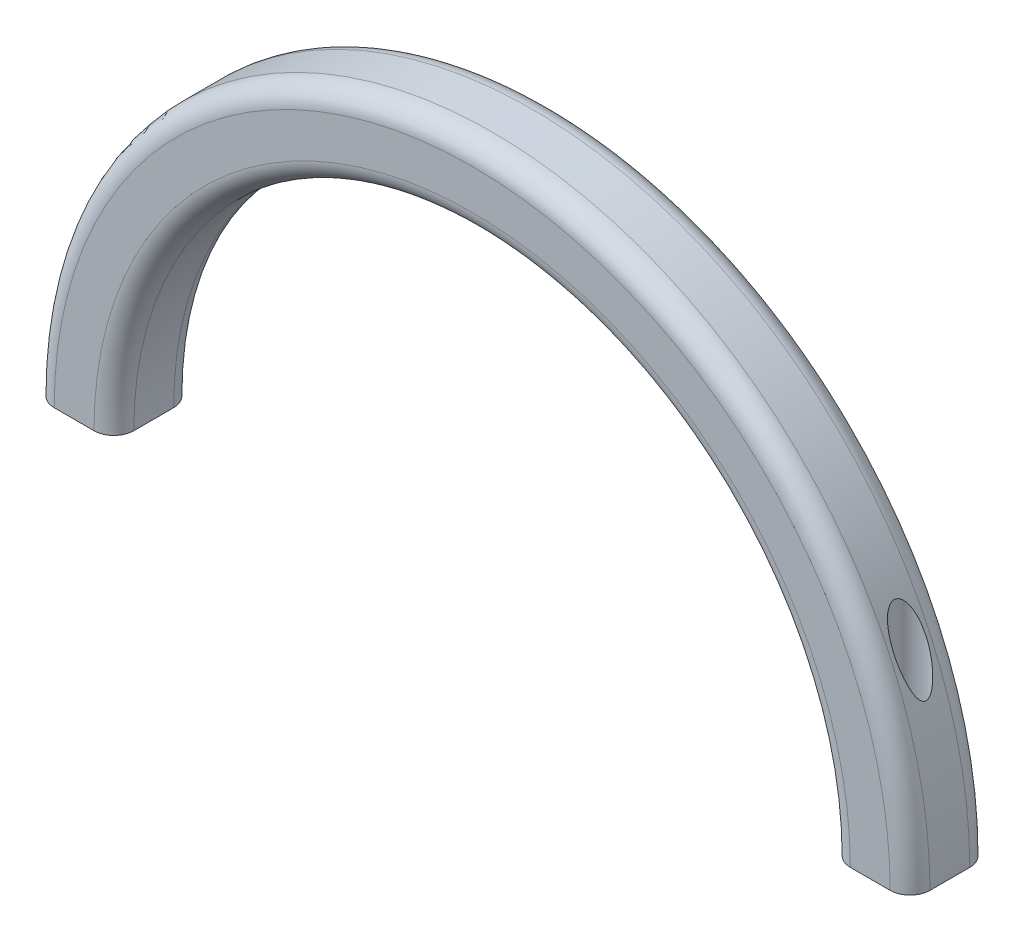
ISO-10303-21;
HEADER;
FILE_DESCRIPTION(('STEP AP214'),'2;1');
FILE_NAME('part.step','',(''),(''),'','','');
FILE_SCHEMA(('AUTOMOTIVE_DESIGN { 1 0 10303 214 1 1 1 1 }'));
ENDSEC;
DATA;
#1=APPLICATION_CONTEXT('core data for automotive mechanical design processes');
#2=APPLICATION_PROTOCOL_DEFINITION('international standard','automotive_design',2000,#1);
#3=PRODUCT_CONTEXT('',#1,'mechanical');
#4=PRODUCT('Part','Part','',(#3));
#5=PRODUCT_RELATED_PRODUCT_CATEGORY('part','',(#4));
#6=PRODUCT_DEFINITION_FORMATION('','',#4);
#7=PRODUCT_DEFINITION_CONTEXT('part definition',#1,'design');
#8=PRODUCT_DEFINITION('design','',#6,#7);
#9=PRODUCT_DEFINITION_SHAPE('','',#8);
#10=(LENGTH_UNIT() NAMED_UNIT(*) SI_UNIT(.MILLI.,.METRE.));
#11=(NAMED_UNIT(*) PLANE_ANGLE_UNIT() SI_UNIT($,.RADIAN.));
#12=(NAMED_UNIT(*) SI_UNIT($,.STERADIAN.) SOLID_ANGLE_UNIT());
#13=UNCERTAINTY_MEASURE_WITH_UNIT(LENGTH_MEASURE(1.E-05),#10,'distance_accuracy_value','');
#14=(GEOMETRIC_REPRESENTATION_CONTEXT(3) GLOBAL_UNCERTAINTY_ASSIGNED_CONTEXT((#13)) GLOBAL_UNIT_ASSIGNED_CONTEXT((#10,
#11,#12)) REPRESENTATION_CONTEXT('',''));
#15=CARTESIAN_POINT('',(0.,0.,0.));
#16=DIRECTION('',(0.,0.,1.));
#17=DIRECTION('',(1.,0.,0.));
#18=AXIS2_PLACEMENT_3D('',#15,#16,#17);
#19=CARTESIAN_POINT('',(0.,0.,6.35));
#20=DIRECTION('',(0.,1.,0.));
#21=DIRECTION('',(0.,0.,1.));
#22=AXIS2_PLACEMENT_3D('',#19,#20,#21);
#23=PLANE('',#22);
#24=CARTESIAN_POINT('',(-63.5,0.,0.));
#25=DIRECTION('',(0.,-1.,0.));
#26=DIRECTION('',(0.,0.,-1.));
#27=AXIS2_PLACEMENT_3D('',#24,#25,#26);
#28=CIRCLE('',#27,2.55269999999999);
#29=CARTESIAN_POINT('',(-63.5,0.,-2.55269999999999));
#30=VERTEX_POINT('',#29);
#31=EDGE_CURVE('E254',#30,#30,#28,.T.);
#32=ORIENTED_EDGE('',*,*,#31,.F.);
#33=EDGE_LOOP('',(#32));
#34=FACE_BOUND('',#33,.T.);
#35=DIRECTION('',(0.,0.,-1.));
#36=VECTOR('',#35,1.);
#37=CARTESIAN_POINT('',(-69.85,0.,6.35));
#38=LINE('',#37,#36);
#39=CARTESIAN_POINT('',(-69.85,0.,3.175));
#40=VERTEX_POINT('',#39);
#41=CARTESIAN_POINT('',(-69.85,0.,-3.175));
#42=VERTEX_POINT('',#41);
#43=EDGE_CURVE('E123',#40,#42,#38,.T.);
#44=ORIENTED_EDGE('',*,*,#43,.T.);
#45=CARTESIAN_POINT('',(-66.675,0.,-3.175));
#46=DIRECTION('',(0.,1.,0.));
#47=DIRECTION('',(0.,0.,1.));
#48=AXIS2_PLACEMENT_3D('',#45,#46,#47);
#49=CIRCLE('',#48,3.175);
#50=CARTESIAN_POINT('',(-66.675,0.,-6.35));
#51=VERTEX_POINT('',#50);
#52=EDGE_CURVE('E118',#42,#51,#49,.F.);
#53=ORIENTED_EDGE('',*,*,#52,.T.);
#54=DIRECTION('',(1.,0.,0.));
#55=VECTOR('',#54,1.);
#56=CARTESIAN_POINT('',(0.,0.,-6.35));
#57=LINE('',#56,#55);
#58=CARTESIAN_POINT('',(-60.325,0.,-6.35));
#59=VERTEX_POINT('',#58);
#60=EDGE_CURVE('E120',#51,#59,#57,.T.);
#61=ORIENTED_EDGE('',*,*,#60,.T.);
#62=CARTESIAN_POINT('',(-60.325,0.,-3.175));
#63=DIRECTION('',(0.,1.,0.));
#64=DIRECTION('',(0.,0.,1.));
#65=AXIS2_PLACEMENT_3D('',#62,#63,#64);
#66=CIRCLE('',#65,3.175);
#67=CARTESIAN_POINT('',(-57.15,0.,-3.175));
#68=VERTEX_POINT('',#67);
#69=EDGE_CURVE('E128',#59,#68,#66,.F.);
#70=ORIENTED_EDGE('',*,*,#69,.T.);
#71=DIRECTION('',(0.,0.,-1.));
#72=VECTOR('',#71,1.);
#73=CARTESIAN_POINT('',(-57.15,0.,6.35));
#74=LINE('',#73,#72);
#75=CARTESIAN_POINT('',(-57.15,0.,3.175));
#76=VERTEX_POINT('',#75);
#77=EDGE_CURVE('E152',#76,#68,#74,.T.);
#78=ORIENTED_EDGE('',*,*,#77,.F.);
#79=CARTESIAN_POINT('',(-60.325,0.,3.175));
#80=DIRECTION('',(0.,1.,0.));
#81=DIRECTION('',(0.,0.,1.));
#82=AXIS2_PLACEMENT_3D('',#79,#80,#81);
#83=CIRCLE('',#82,3.175);
#84=CARTESIAN_POINT('',(-60.325,0.,6.35));
#85=VERTEX_POINT('',#84);
#86=EDGE_CURVE('E60',#76,#85,#83,.F.);
#87=ORIENTED_EDGE('',*,*,#86,.T.);
#88=DIRECTION('',(1.,0.,0.));
#89=VECTOR('',#88,1.);
#90=CARTESIAN_POINT('',(0.,0.,6.35));
#91=LINE('',#90,#89);
#92=CARTESIAN_POINT('',(-66.675,0.,6.35));
#93=VERTEX_POINT('',#92);
#94=EDGE_CURVE('E185',#93,#85,#91,.T.);
#95=ORIENTED_EDGE('',*,*,#94,.F.);
#96=CARTESIAN_POINT('',(-66.675,0.,3.175));
#97=DIRECTION('',(0.,1.,0.));
#98=DIRECTION('',(0.,0.,1.));
#99=AXIS2_PLACEMENT_3D('',#96,#97,#98);
#100=CIRCLE('',#99,3.175);
#101=EDGE_CURVE('E171',#93,#40,#100,.F.);
#102=ORIENTED_EDGE('',*,*,#101,.T.);
#103=EDGE_LOOP('',(#44,#53,#61,#70,#78,#87,#95,#102));
#104=FACE_BOUND('',#103,.T.);
#105=ADVANCED_FACE('F44',(#34,#104),#23,.F.);
#106=CARTESIAN_POINT('',(0.,0.,6.35));
#107=DIRECTION('',(0.,0.,-1.));
#108=DIRECTION('',(-1.,0.,0.));
#109=AXIS2_PLACEMENT_3D('',#106,#107,#108);
#110=CYLINDRICAL_SURFACE('',#109,57.15);
#111=ORIENTED_EDGE('',*,*,#77,.T.);
#112=CARTESIAN_POINT('',(0.,0.,-3.175));
#113=DIRECTION('',(0.,0.,1.));
#114=DIRECTION('',(1.,0.,0.));
#115=AXIS2_PLACEMENT_3D('',#112,#113,#114);
#116=CIRCLE('',#115,57.15);
#117=CARTESIAN_POINT('',(57.15,0.,-3.175));
#118=VERTEX_POINT('',#117);
#119=EDGE_CURVE('E176',#68,#118,#116,.F.);
#120=ORIENTED_EDGE('',*,*,#119,.T.);
#121=DIRECTION('',(0.,0.,-1.));
#122=VECTOR('',#121,1.);
#123=CARTESIAN_POINT('',(57.15,0.,6.35));
#124=LINE('',#123,#122);
#125=CARTESIAN_POINT('',(57.15,0.,3.175));
#126=VERTEX_POINT('',#125);
#127=EDGE_CURVE('E202',#126,#118,#124,.T.);
#128=ORIENTED_EDGE('',*,*,#127,.F.);
#129=CARTESIAN_POINT('',(0.,0.,3.175));
#130=DIRECTION('',(0.,0.,1.));
#131=DIRECTION('',(1.,0.,0.));
#132=AXIS2_PLACEMENT_3D('',#129,#130,#131);
#133=CIRCLE('',#132,57.15);
#134=EDGE_CURVE('E127',#126,#76,#133,.T.);
#135=ORIENTED_EDGE('',*,*,#134,.T.);
#136=EDGE_LOOP('',(#111,#120,#128,#135));
#137=FACE_BOUND('',#136,.T.);
#138=ADVANCED_FACE('F235',(#137),#110,.F.);
#139=CARTESIAN_POINT('',(63.5,0.,0.));
#140=DIRECTION('',(0.,-1.,0.));
#141=DIRECTION('',(0.,0.,-1.));
#142=AXIS2_PLACEMENT_3D('',#139,#140,#141);
#143=CIRCLE('',#142,2.55269999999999);
#144=CARTESIAN_POINT('',(63.5,0.,-2.55269999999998));
#145=VERTEX_POINT('',#144);
#146=EDGE_CURVE('E196',#145,#145,#143,.T.);
#147=ORIENTED_EDGE('',*,*,#146,.F.);
#148=EDGE_LOOP('',(#147));
#149=FACE_BOUND('',#148,.T.);
#150=CARTESIAN_POINT('',(60.325,0.,-6.35));
#151=VERTEX_POINT('',#150);
#152=CARTESIAN_POINT('',(66.675,0.,-6.35));
#153=VERTEX_POINT('',#152);
#154=EDGE_CURVE('E138',#151,#153,#57,.T.);
#155=ORIENTED_EDGE('',*,*,#154,.T.);
#156=CARTESIAN_POINT('',(66.675,0.,-3.175));
#157=DIRECTION('',(0.,1.,0.));
#158=DIRECTION('',(0.,0.,1.));
#159=AXIS2_PLACEMENT_3D('',#156,#157,#158);
#160=CIRCLE('',#159,3.175);
#161=CARTESIAN_POINT('',(69.85,0.,-3.175));
#162=VERTEX_POINT('',#161);
#163=EDGE_CURVE('E142',#153,#162,#160,.F.);
#164=ORIENTED_EDGE('',*,*,#163,.T.);
#165=DIRECTION('',(0.,0.,-1.));
#166=VECTOR('',#165,1.);
#167=CARTESIAN_POINT('',(69.85,0.,6.35));
#168=LINE('',#167,#166);
#169=CARTESIAN_POINT('',(69.85,0.,3.175));
#170=VERTEX_POINT('',#169);
#171=EDGE_CURVE('E193',#170,#162,#168,.T.);
#172=ORIENTED_EDGE('',*,*,#171,.F.);
#173=CARTESIAN_POINT('',(66.675,0.,3.175));
#174=DIRECTION('',(0.,1.,0.));
#175=DIRECTION('',(0.,0.,1.));
#176=AXIS2_PLACEMENT_3D('',#173,#174,#175);
#177=CIRCLE('',#176,3.175);
#178=CARTESIAN_POINT('',(66.675,0.,6.35));
#179=VERTEX_POINT('',#178);
#180=EDGE_CURVE('E149',#170,#179,#177,.F.);
#181=ORIENTED_EDGE('',*,*,#180,.T.);
#182=CARTESIAN_POINT('',(60.325,0.,6.35));
#183=VERTEX_POINT('',#182);
#184=EDGE_CURVE('E184',#183,#179,#91,.T.);
#185=ORIENTED_EDGE('',*,*,#184,.F.);
#186=CARTESIAN_POINT('',(60.325,0.,3.175));
#187=DIRECTION('',(0.,1.,0.));
#188=DIRECTION('',(0.,0.,1.));
#189=AXIS2_PLACEMENT_3D('',#186,#187,#188);
#190=CIRCLE('',#189,3.175);
#191=EDGE_CURVE('E144',#183,#126,#190,.F.);
#192=ORIENTED_EDGE('',*,*,#191,.T.);
#193=ORIENTED_EDGE('',*,*,#127,.T.);
#194=CARTESIAN_POINT('',(60.325,0.,-3.175));
#195=DIRECTION('',(0.,1.,0.));
#196=DIRECTION('',(0.,0.,1.));
#197=AXIS2_PLACEMENT_3D('',#194,#195,#196);
#198=CIRCLE('',#197,3.175);
#199=EDGE_CURVE('E158',#118,#151,#198,.F.);
#200=ORIENTED_EDGE('',*,*,#199,.T.);
#201=EDGE_LOOP('',(#155,#164,#172,#181,#185,#192,#193,#200));
#202=FACE_BOUND('',#201,.T.);
#203=ADVANCED_FACE('F188',(#149,#202),#23,.F.);
#204=CARTESIAN_POINT('',(0.,0.,6.35));
#205=DIRECTION('',(0.,0.,-1.));
#206=DIRECTION('',(-1.,0.,0.));
#207=AXIS2_PLACEMENT_3D('',#204,#205,#206);
#208=CYLINDRICAL_SURFACE('',#207,69.85);
#209=CARTESIAN_POINT('',(-63.5,29.0993556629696,-2.55269999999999));
#210=CARTESIAN_POINT('',(-63.5887699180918,28.9056452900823,-2.55269420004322));
#211=CARTESIAN_POINT('',(-63.6766374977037,28.7115599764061,-2.54807851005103));
#212=CARTESIAN_POINT('',(-63.850456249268,28.3229064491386,-2.53003938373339));
#213=CARTESIAN_POINT('',(-63.9364072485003,28.1283381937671,-2.51661515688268));
#214=CARTESIAN_POINT('',(-64.1063855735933,27.7387648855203,-2.48115357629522));
#215=CARTESIAN_POINT('',(-64.1904094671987,27.5437596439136,-2.45910195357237));
#216=CARTESIAN_POINT('',(-64.3562582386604,27.1539937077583,-2.40638139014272));
#217=CARTESIAN_POINT('',(-64.4380832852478,26.9592329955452,-2.37571311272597));
#218=CARTESIAN_POINT('',(-64.599317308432,26.5705647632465,-2.3055375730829));
#219=CARTESIAN_POINT('',(-64.6787289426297,26.3766565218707,-2.2660404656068));
#220=CARTESIAN_POINT('',(-64.8350638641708,25.9900072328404,-2.17760160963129));
#221=CARTESIAN_POINT('',(-64.9119873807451,25.7972660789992,-2.12866073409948));
#222=CARTESIAN_POINT('',(-65.0629711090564,25.4140624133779,-2.02040314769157));
#223=CARTESIAN_POINT('',(-65.1370373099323,25.2235957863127,-1.9611097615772));
#224=CARTESIAN_POINT('',(-65.2458164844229,24.9402522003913,-1.86300085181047));
#225=CARTESIAN_POINT('',(-65.2816817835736,24.8462177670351,-1.82877839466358));
#226=CARTESIAN_POINT('',(-65.3525758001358,24.6591430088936,-1.75692669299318));
#227=CARTESIAN_POINT('',(-65.3876045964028,24.5661025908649,-1.71929777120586));
#228=CARTESIAN_POINT('',(-65.4564032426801,24.3821927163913,-1.64057025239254));
#229=CARTESIAN_POINT('',(-65.4901819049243,24.2913110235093,-1.5995081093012));
#230=CARTESIAN_POINT('',(-65.5567032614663,24.1112084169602,-1.51301973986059));
#231=CARTESIAN_POINT('',(-65.5894456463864,24.0219880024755,-1.46759222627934));
#232=CARTESIAN_POINT('',(-65.6535325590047,23.8462757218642,-1.37181707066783));
#233=CARTESIAN_POINT('',(-65.6848828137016,23.7597732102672,-1.32149297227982));
#234=CARTESIAN_POINT('',(-65.7460101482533,23.590098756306,-1.21470432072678));
#235=CARTESIAN_POINT('',(-65.7757883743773,23.5069243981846,-1.15824433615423));
#236=CARTESIAN_POINT('',(-65.8275901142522,23.3614130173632,-1.04951245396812));
#237=CARTESIAN_POINT('',(-65.8499859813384,23.2981979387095,-0.998605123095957));
#238=CARTESIAN_POINT('',(-65.8930111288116,23.1762327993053,-0.890597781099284));
#239=CARTESIAN_POINT('',(-65.9136358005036,23.1174944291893,-0.833482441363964));
#240=CARTESIAN_POINT('',(-65.9525236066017,23.0063172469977,-0.711057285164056));
#241=CARTESIAN_POINT('',(-65.9707514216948,22.9539733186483,-0.645647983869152));
#242=CARTESIAN_POINT('',(-66.0030405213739,22.860961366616,-0.506091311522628));
#243=CARTESIAN_POINT('',(-66.0171220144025,22.8202367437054,-0.431988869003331));
#244=CARTESIAN_POINT('',(-66.0344535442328,22.7700206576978,-0.308131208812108));
#245=CARTESIAN_POINT('',(-66.0397719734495,22.7545856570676,-0.261096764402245));
#246=CARTESIAN_POINT('',(-66.0478174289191,22.731222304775,-0.164982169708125));
#247=CARTESIAN_POINT('',(-66.0505475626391,22.7232849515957,-0.11590454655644));
#248=CARTESIAN_POINT('',(-66.0531274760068,22.7157845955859,-0.0167991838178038));
#249=CARTESIAN_POINT('',(-66.0529645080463,22.7162586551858,0.0332317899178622));
#250=CARTESIAN_POINT('',(-66.0497475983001,22.725610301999,0.132413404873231));
#251=CARTESIAN_POINT('',(-66.0466914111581,22.7344944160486,0.181563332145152));
#252=CARTESIAN_POINT('',(-66.0371592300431,22.7621692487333,0.287118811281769));
#253=CARTESIAN_POINT('',(-66.0301279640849,22.7825672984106,0.343045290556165));
#254=CARTESIAN_POINT('',(-66.013195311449,22.8315837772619,0.450679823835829));
#255=CARTESIAN_POINT('',(-66.0032882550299,22.8602184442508,0.502379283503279));
#256=CARTESIAN_POINT('',(-65.9743839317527,22.9435418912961,0.632938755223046));
#257=CARTESIAN_POINT('',(-65.9536115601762,23.0032217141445,0.708172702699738));
#258=CARTESIAN_POINT('',(-65.9085692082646,23.1319631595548,0.848846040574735));
#259=CARTESIAN_POINT('',(-65.8842889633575,23.2010522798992,0.914255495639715));
#260=CARTESIAN_POINT('',(-65.8249015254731,23.3691074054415,1.05783387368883));
#261=CARTESIAN_POINT('',(-65.7888906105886,23.4703333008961,1.13294546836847));
#262=CARTESIAN_POINT('',(-65.7141389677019,23.6788258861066,1.2728462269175));
#263=CARTESIAN_POINT('',(-65.6753930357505,23.786104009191,1.3376149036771));
#264=CARTESIAN_POINT('',(-65.5957137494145,24.0049675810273,1.45930412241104));
#265=CARTESIAN_POINT('',(-65.5547704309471,24.1165718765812,1.51618382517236));
#266=CARTESIAN_POINT('',(-65.4713132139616,24.342229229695,1.62320459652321));
#267=CARTESIAN_POINT('',(-65.4288006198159,24.4562802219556,1.67335110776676));
#268=CARTESIAN_POINT('',(-65.3272825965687,24.7264254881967,1.78460456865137));
#269=CARTESIAN_POINT('',(-65.2677147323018,24.8832572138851,1.843400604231));
#270=CARTESIAN_POINT('',(-65.1464356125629,25.1990689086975,1.9524769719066));
#271=CARTESIAN_POINT('',(-65.0847235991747,25.3580496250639,2.00275425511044));
#272=CARTESIAN_POINT('',(-64.9592965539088,25.6776518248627,2.09591021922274));
#273=CARTESIAN_POINT('',(-64.8955787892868,25.8382753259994,2.13877823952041));
#274=CARTESIAN_POINT('',(-64.7663617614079,26.1604859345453,2.21773202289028));
#275=CARTESIAN_POINT('',(-64.7008622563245,26.32207317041,2.25381686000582));
#276=CARTESIAN_POINT('',(-64.5681737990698,26.6459012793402,2.31964840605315));
#277=CARTESIAN_POINT('',(-64.5009843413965,26.8081423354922,2.34939319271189));
#278=CARTESIAN_POINT('',(-64.3650185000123,27.1329673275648,2.40277921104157));
#279=CARTESIAN_POINT('',(-64.2962419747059,27.2955512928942,2.42641989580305));
#280=CARTESIAN_POINT('',(-64.0877779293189,27.7831602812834,2.48834223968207));
#281=CARTESIAN_POINT('',(-63.945808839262,28.108401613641,2.51769628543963));
#282=CARTESIAN_POINT('',(-63.6776499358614,28.7101292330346,2.54953910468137));
#283=CARTESIAN_POINT('',(-63.5521952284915,28.9867780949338,2.55533349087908));
#284=CARTESIAN_POINT('',(-63.2976803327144,29.5384222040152,2.54785882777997));
#285=CARTESIAN_POINT('',(-63.1686183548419,29.8134165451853,2.53458014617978));
#286=CARTESIAN_POINT('',(-62.9729976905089,30.223285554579,2.49858302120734));
#287=CARTESIAN_POINT('',(-62.9074890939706,30.359398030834,2.4839164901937));
#288=CARTESIAN_POINT('',(-62.7758909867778,30.6305845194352,2.44879282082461));
#289=CARTESIAN_POINT('',(-62.7098015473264,30.7656586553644,2.42833638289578));
#290=CARTESIAN_POINT('',(-62.5772481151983,31.0343833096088,2.38112411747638));
#291=CARTESIAN_POINT('',(-62.5107844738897,31.1680349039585,2.35437346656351));
#292=CARTESIAN_POINT('',(-62.3776530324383,31.4336278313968,2.29389642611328));
#293=CARTESIAN_POINT('',(-62.3109852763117,31.5655695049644,2.26017144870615));
#294=CARTESIAN_POINT('',(-62.1774486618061,31.8278040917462,2.18472958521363));
#295=CARTESIAN_POINT('',(-62.110580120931,31.9580878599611,2.14298002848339));
#296=CARTESIAN_POINT('',(-61.9773732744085,32.2156592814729,2.05047841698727));
#297=CARTESIAN_POINT('',(-61.9110347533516,32.3429481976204,1.99973023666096));
#298=CARTESIAN_POINT('',(-61.7798088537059,32.5929063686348,1.88801888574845));
#299=CARTESIAN_POINT('',(-61.7149161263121,32.7155944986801,1.82710476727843));
#300=CARTESIAN_POINT('',(-61.5872995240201,32.9552027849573,1.69305148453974));
#301=CARTESIAN_POINT('',(-61.5245730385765,33.0721299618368,1.61992770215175));
#302=CARTESIAN_POINT('',(-61.4193062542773,33.2671021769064,1.48067648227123));
#303=CARTESIAN_POINT('',(-61.3758898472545,33.3471189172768,1.41799408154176));
#304=CARTESIAN_POINT('',(-61.2919930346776,33.5010711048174,1.28346301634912));
#305=CARTESIAN_POINT('',(-61.2515162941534,33.5749989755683,1.21160320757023));
#306=CARTESIAN_POINT('',(-61.1746767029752,33.7148016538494,1.05674413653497));
#307=CARTESIAN_POINT('',(-61.1383608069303,33.7805851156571,0.973637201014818));
#308=CARTESIAN_POINT('',(-61.0727594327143,33.8990432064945,0.796035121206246));
#309=CARTESIAN_POINT('',(-61.0434550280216,33.951753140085,0.701571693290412));
#310=CARTESIAN_POINT('',(-61.002855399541,34.0246276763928,0.534213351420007));
#311=CARTESIAN_POINT('',(-60.9888000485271,34.0498059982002,0.464187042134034));
#312=CARTESIAN_POINT('',(-60.9664395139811,34.0898266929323,0.320351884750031));
#313=CARTESIAN_POINT('',(-60.9581282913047,34.1046799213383,0.24654709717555));
#314=CARTESIAN_POINT('',(-60.9480196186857,34.1227419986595,0.0966440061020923));
#315=CARTESIAN_POINT('',(-60.9462573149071,34.1258880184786,0.0205355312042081));
#316=CARTESIAN_POINT('',(-60.9495393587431,34.1200258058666,-0.131068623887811));
#317=CARTESIAN_POINT('',(-60.9545851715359,34.1110149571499,-0.206564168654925));
#318=CARTESIAN_POINT('',(-60.9703982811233,34.0827414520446,-0.349618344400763));
#319=CARTESIAN_POINT('',(-60.9807609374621,34.0642036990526,-0.417370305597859));
#320=CARTESIAN_POINT('',(-61.0061392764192,34.0187323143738,-0.549035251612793));
#321=CARTESIAN_POINT('',(-61.0211569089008,33.9917951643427,-0.612946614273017));
#322=CARTESIAN_POINT('',(-61.0645577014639,33.9137911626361,-0.771332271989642));
#323=CARTESIAN_POINT('',(-61.0956896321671,33.8577053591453,-0.862572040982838));
#324=CARTESIAN_POINT('',(-61.1642501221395,33.7336929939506,-1.03398755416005));
#325=CARTESIAN_POINT('',(-61.2016963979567,33.6657330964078,-1.11413097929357));
#326=CARTESIAN_POINT('',(-61.274684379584,33.5326768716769,-1.25275545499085));
#327=CARTESIAN_POINT('',(-61.3096423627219,33.4687305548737,-1.31267520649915));
#328=CARTESIAN_POINT('',(-61.3816950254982,33.3364019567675,-1.42603537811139));
#329=CARTESIAN_POINT('',(-61.4187912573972,33.2680164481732,-1.47947100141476));
#330=CARTESIAN_POINT('',(-61.4945434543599,33.1277827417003,-1.58063945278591));
#331=CARTESIAN_POINT('',(-61.5332021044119,33.055928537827,-1.628361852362));
#332=CARTESIAN_POINT('',(-61.6115899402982,32.9095942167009,-1.7186488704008));
#333=CARTESIAN_POINT('',(-61.6513195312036,32.835113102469,-1.7612115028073));
#334=CARTESIAN_POINT('',(-61.7708193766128,32.6100743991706,-1.88120006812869));
#335=CARTESIAN_POINT('',(-61.8516709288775,32.4564976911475,-1.95191199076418));
#336=CARTESIAN_POINT('',(-62.0146505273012,32.1440008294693,-2.07861749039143));
#337=CARTESIAN_POINT('',(-62.0967797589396,31.9850755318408,-2.13459641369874));
#338=CARTESIAN_POINT('',(-62.2613770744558,31.6634816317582,-2.2341303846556));
#339=CARTESIAN_POINT('',(-62.3438453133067,31.5008111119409,-2.27767890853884));
#340=CARTESIAN_POINT('',(-62.5084437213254,31.1729148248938,-2.35399970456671));
#341=CARTESIAN_POINT('',(-62.5905740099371,31.0076900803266,-2.3867761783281));
#342=CARTESIAN_POINT('',(-62.7427402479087,30.6984765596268,-2.43892732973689));
#343=CARTESIAN_POINT('',(-62.8128668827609,30.5547365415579,-2.45953300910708));
#344=CARTESIAN_POINT('',(-62.9524318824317,30.2661449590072,-2.4943162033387));
#345=CARTESIAN_POINT('',(-63.021870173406,30.1212932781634,-2.50849303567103));
#346=CARTESIAN_POINT('',(-63.2290475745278,29.6852414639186,-2.54214392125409));
#347=CARTESIAN_POINT('',(-63.3655586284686,29.3927285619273,-2.55270878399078));
#348=CARTESIAN_POINT('',(-63.5,29.0993556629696,-2.55269999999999));
#349=B_SPLINE_CURVE_WITH_KNOTS('',3,(#209,#210,#211,#212,#213,#214,#215,#216,#217,#218,#219,
#220,#221,#222,#223,#224,#225,#226,#227,#228,#229,#230,#231,#232,#233,#234,#235,#236,#237,#238,
#239,#240,#241,#242,#243,#244,#245,#246,#247,#248,#249,#250,#251,#252,#253,#254,#255,#256,#257,
#258,#259,#260,#261,#262,#263,#264,#265,#266,#267,#268,#269,#270,#271,#272,#273,#274,#275,#276,
#277,#278,#279,#280,#281,#282,#283,#284,#285,#286,#287,#288,#289,#290,#291,#292,#293,#294,#295,
#296,#297,#298,#299,#300,#301,#302,#303,#304,#305,#306,#307,#308,#309,#310,#311,#312,#313,#314,
#315,#316,#317,#318,#319,#320,#321,#322,#323,#324,#325,#326,#327,#328,#329,#330,#331,#332,#333,
#334,#335,#336,#337,#338,#339,#340,#341,#342,#343,#344,#345,#346,#347,#348),.UNSPECIFIED.,.T.,
.F.,(4,2,2,2,2,2,2,2,2,2,2,2,2,2,2,2,2,2,2,2,2,2,2,2,2,2,2,2,2,2,2,2,2,2,2,2,2,2,2,2,2,2,2,2,2,
2,2,2,2,2,2,2,2,2,2,2,2,2,2,2,2,2,2,2,2,2,2,2,2,4),(0.,0.639137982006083,1.27833333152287,
1.91859035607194,2.55879810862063,3.19827326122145,3.8376893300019,4.47568292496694,
4.79453757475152,5.11336204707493,5.42915037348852,5.74503210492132,6.05946375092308,
6.37366286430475,6.62599148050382,6.87895793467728,7.13531165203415,7.39039444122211,
7.53918971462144,7.68780611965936,7.83707752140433,7.9864648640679,8.16529348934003,
8.3444771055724,8.63756554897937,8.93152966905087,9.32388819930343,9.71701451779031,
10.1121055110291,10.5068751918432,11.0398816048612,11.5730783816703,12.1070360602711,
12.6410665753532,13.1752587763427,13.7094988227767,14.77679697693,15.6877444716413,
16.599152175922,17.0543602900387,17.5095133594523,17.9642933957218,18.4189814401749,
18.8755614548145,19.3319453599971,19.786187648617,20.2398619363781,20.5709977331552,
20.9025395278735,21.2375154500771,21.5715766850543,21.7979060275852,22.0239970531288,
22.2512997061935,22.478651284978,22.6908182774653,22.9030742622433,23.2357649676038,
23.5694051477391,23.8520493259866,24.1349013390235,24.4182620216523,24.7017314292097,
25.2630177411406,25.8248602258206,26.3869970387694,26.9489143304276,27.4325378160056,
27.9162126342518,28.8841822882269),.UNSPECIFIED.);
#350=CARTESIAN_POINT('',(-63.5,29.0993556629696,-2.55269999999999));
#351=VERTEX_POINT('',#350);
#352=EDGE_CURVE('E214',#351,#351,#349,.T.);
#353=ORIENTED_EDGE('',*,*,#352,.F.);
#354=EDGE_LOOP('',(#353));
#355=FACE_BOUND('',#354,.T.);
#356=CARTESIAN_POINT('',(63.5,29.0993556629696,-2.55269999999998));
#357=CARTESIAN_POINT('',(63.3865029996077,29.3470261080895,-2.5527008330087));
#358=CARTESIAN_POINT('',(63.2715500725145,29.594043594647,-2.54515900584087));
#359=CARTESIAN_POINT('',(63.0391204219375,30.0859741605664,-2.51349041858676));
#360=CARTESIAN_POINT('',(62.921642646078,30.3308863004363,-2.48935660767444));
#361=CARTESIAN_POINT('',(62.6847574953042,30.8174762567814,-2.42215931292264));
#362=CARTESIAN_POINT('',(62.5653490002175,31.0591520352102,-2.37908443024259));
#363=CARTESIAN_POINT('',(62.3857692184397,31.417450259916,-2.29762047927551));
#364=CARTESIAN_POINT('',(62.3258517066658,31.5361411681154,-2.26767014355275));
#365=CARTESIAN_POINT('',(62.206060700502,31.7717792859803,-2.20151913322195));
#366=CARTESIAN_POINT('',(62.1461871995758,31.8887268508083,-2.16531975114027));
#367=CARTESIAN_POINT('',(62.0265179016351,32.1208763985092,-2.08574044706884));
#368=CARTESIAN_POINT('',(61.9667234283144,32.2360692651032,-2.04233170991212));
#369=CARTESIAN_POINT('',(61.8478986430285,32.4634621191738,-1.94746485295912));
#370=CARTESIAN_POINT('',(61.7888680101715,32.5756633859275,-1.89601024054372));
#371=CARTESIAN_POINT('',(61.6724476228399,32.7955347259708,-1.7840471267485));
#372=CARTESIAN_POINT('',(61.6150511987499,32.9032244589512,-1.72358464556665));
#373=CARTESIAN_POINT('',(61.5025713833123,33.1129933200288,-1.59187229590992));
#374=CARTESIAN_POINT('',(61.4474852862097,33.2150790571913,-1.52063552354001));
#375=CARTESIAN_POINT('',(61.3527445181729,33.3896816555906,-1.38237515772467));
#376=CARTESIAN_POINT('',(61.3123567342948,33.4637703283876,-1.31785904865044));
#377=CARTESIAN_POINT('',(61.2349006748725,33.6052963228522,-1.17977835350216));
#378=CARTESIAN_POINT('',(61.1978368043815,33.672724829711,-1.1062020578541));
#379=CARTESIAN_POINT('',(61.1283137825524,33.7987719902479,-0.948120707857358));
#380=CARTESIAN_POINT('',(61.0959136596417,33.8572781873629,-0.863497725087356));
#381=CARTESIAN_POINT('',(61.0387784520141,33.9601751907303,-0.683721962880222));
#382=CARTESIAN_POINT('',(61.0140197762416,34.0046094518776,-0.588602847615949));
#383=CARTESIAN_POINT('',(60.9812984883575,34.0632425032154,-0.420996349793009));
#384=CARTESIAN_POINT('',(60.9705004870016,34.0825589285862,-0.350859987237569));
#385=CARTESIAN_POINT('',(60.9547649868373,34.1106932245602,-0.207869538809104));
#386=CARTESIAN_POINT('',(60.9498222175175,34.1195205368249,-0.135017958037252));
#387=CARTESIAN_POINT('',(60.9462712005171,34.1258632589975,0.0115400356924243));
#388=CARTESIAN_POINT('',(60.9476802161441,34.1233478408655,0.0852482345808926));
#389=CARTESIAN_POINT('',(60.9567269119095,34.1071843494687,0.231046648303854));
#390=CARTESIAN_POINT('',(60.964367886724,34.0935303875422,0.303135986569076));
#391=CARTESIAN_POINT('',(60.9849103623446,34.0567706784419,0.442062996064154));
#392=CARTESIAN_POINT('',(60.9976770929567,34.0339070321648,0.508986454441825));
#393=CARTESIAN_POINT('',(61.0275525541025,33.9803071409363,0.638519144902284));
#394=CARTESIAN_POINT('',(61.0446627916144,33.9495681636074,0.70112687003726));
#395=CARTESIAN_POINT('',(61.0951885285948,33.8585978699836,0.862819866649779));
#396=CARTESIAN_POINT('',(61.1317626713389,33.7925558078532,0.957640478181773));
#397=CARTESIAN_POINT('',(61.2112495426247,33.6483617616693,1.13462485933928));
#398=CARTESIAN_POINT('',(61.2541827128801,33.5701706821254,1.21674599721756));
#399=CARTESIAN_POINT('',(61.3384407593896,33.4159383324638,1.36012607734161));
#400=CARTESIAN_POINT('',(61.379296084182,33.340849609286,1.42270964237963));
#401=CARTESIAN_POINT('',(61.4631316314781,33.186046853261,1.54034652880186));
#402=CARTESIAN_POINT('',(61.5061135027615,33.1063292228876,1.59539387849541));
#403=CARTESIAN_POINT('',(61.5935495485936,32.9433714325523,1.69891649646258));
#404=CARTESIAN_POINT('',(61.6380055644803,32.8601268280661,1.74738312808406));
#405=CARTESIAN_POINT('',(61.727883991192,32.6909776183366,1.83847108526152));
#406=CARTESIAN_POINT('',(61.7733067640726,32.6050720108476,1.88109017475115));
#407=CARTESIAN_POINT('',(61.8650656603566,32.4306325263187,1.96137899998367));
#408=CARTESIAN_POINT('',(61.9114058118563,32.3420851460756,1.99901458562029));
#409=CARTESIAN_POINT('',(62.004467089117,32.1633134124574,2.06955631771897));
#410=CARTESIAN_POINT('',(62.0511882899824,32.0730887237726,2.10246150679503));
#411=CARTESIAN_POINT('',(62.191695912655,31.8002714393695,2.19481678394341));
#412=CARTESIAN_POINT('',(62.2857705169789,31.6156416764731,2.24785931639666));
#413=CARTESIAN_POINT('',(62.4738439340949,31.2423618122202,2.33970885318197));
#414=CARTESIAN_POINT('',(62.5678420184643,31.0537030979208,2.37848125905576));
#415=CARTESIAN_POINT('',(62.7549152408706,30.6738961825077,2.44354797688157));
#416=CARTESIAN_POINT('',(62.8479906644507,30.4827487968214,2.46984627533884));
#417=CARTESIAN_POINT('',(63.0266772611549,30.1114602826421,2.50999082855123));
#418=CARTESIAN_POINT('',(63.1123724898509,29.9314346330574,2.52455014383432));
#419=CARTESIAN_POINT('',(63.2824144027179,29.5702279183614,2.5448508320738));
#420=CARTESIAN_POINT('',(63.3667608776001,29.3890466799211,2.55059084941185));
#421=CARTESIAN_POINT('',(63.5339910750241,29.0257558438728,2.55384437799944));
#422=CARTESIAN_POINT('',(63.6168734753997,28.8436455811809,2.55135080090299));
#423=CARTESIAN_POINT('',(63.780977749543,28.478928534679,2.53852381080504));
#424=CARTESIAN_POINT('',(63.8621994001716,28.2963216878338,2.52818935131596));
#425=CARTESIAN_POINT('',(64.022906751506,27.9308036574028,2.49990136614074));
#426=CARTESIAN_POINT('',(64.1023913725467,27.7478923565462,2.48194323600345));
#427=CARTESIAN_POINT('',(64.2594616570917,27.3821782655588,2.4384699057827));
#428=CARTESIAN_POINT('',(64.337047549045,27.1993754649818,2.41295561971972));
#429=CARTESIAN_POINT('',(64.4901593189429,26.8343248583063,2.35426833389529));
#430=CARTESIAN_POINT('',(64.5656869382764,26.6520767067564,2.32110204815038));
#431=CARTESIAN_POINT('',(64.7146230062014,26.2883753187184,2.24675255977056));
#432=CARTESIAN_POINT('',(64.7880317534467,26.1069219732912,2.20557049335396));
#433=CARTESIAN_POINT('',(64.932741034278,25.7448967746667,2.11444161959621));
#434=CARTESIAN_POINT('',(65.004036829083,25.5643275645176,2.06447663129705));
#435=CARTESIAN_POINT('',(65.1441687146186,25.2050982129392,1.95471620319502));
#436=CARTESIAN_POINT('',(65.2130034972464,25.0264391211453,1.89491562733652));
#437=CARTESIAN_POINT('',(65.3477029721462,24.6725742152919,1.76383805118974));
#438=CARTESIAN_POINT('',(65.413573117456,24.4973624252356,1.69258332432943));
#439=CARTESIAN_POINT('',(65.5096902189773,24.2386359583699,1.5747906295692));
#440=CARTESIAN_POINT('',(65.5412668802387,24.1531153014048,1.53373004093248));
#441=CARTESIAN_POINT('',(65.6033884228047,23.9838703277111,1.44736733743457));
#442=CARTESIAN_POINT('',(65.6339336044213,23.9001454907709,1.40206647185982));
#443=CARTESIAN_POINT('',(65.6875058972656,23.7524500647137,1.31646464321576));
#444=CARTESIAN_POINT('',(65.7107663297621,23.6880187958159,1.27710732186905));
#445=CARTESIAN_POINT('',(65.7563615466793,23.5611535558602,1.19470935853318));
#446=CARTESIAN_POINT('',(65.7786959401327,23.4987204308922,1.15166718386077));
#447=CARTESIAN_POINT('',(65.8220888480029,23.3768962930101,1.061450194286));
#448=CARTESIAN_POINT('',(65.8431526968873,23.3174927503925,1.01429503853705));
#449=CARTESIAN_POINT('',(65.8837279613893,23.2025987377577,0.914877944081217));
#450=CARTESIAN_POINT('',(65.9032411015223,23.1471039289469,0.862621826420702));
#451=CARTESIAN_POINT('',(65.936764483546,23.0514136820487,0.76205358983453));
#452=CARTESIAN_POINT('',(65.9511285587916,23.0102760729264,0.714767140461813));
#453=CARTESIAN_POINT('',(65.977944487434,22.9332728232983,0.615401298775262));
#454=CARTESIAN_POINT('',(65.9903940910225,22.897413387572,0.56331638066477));
#455=CARTESIAN_POINT('',(66.01277511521,22.8328098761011,0.45325021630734));
#456=CARTESIAN_POINT('',(66.0226684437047,22.8041735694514,0.3951960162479));
#457=CARTESIAN_POINT('',(66.0386316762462,22.7579050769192,0.274393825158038));
#458=CARTESIAN_POINT('',(66.0447152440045,22.7402335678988,0.21166352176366));
#459=CARTESIAN_POINT('',(66.0511497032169,22.7215358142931,0.100673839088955));
#460=CARTESIAN_POINT('',(66.0525960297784,22.7173294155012,0.0530112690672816));
#461=CARTESIAN_POINT('',(66.0527928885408,22.7167571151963,-0.0423739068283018));
#462=CARTESIAN_POINT('',(66.0515436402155,22.7203905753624,-0.0900965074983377));
#463=CARTESIAN_POINT('',(66.0464920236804,22.7350708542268,-0.184023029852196));
#464=CARTESIAN_POINT('',(66.0426995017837,22.746089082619,-0.230232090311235));
#465=CARTESIAN_POINT('',(66.032919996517,22.7744637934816,-0.320400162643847));
#466=CARTESIAN_POINT('',(66.0269311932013,22.7918255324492,-0.364357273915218));
#467=CARTESIAN_POINT('',(66.008949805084,22.8438653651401,-0.47571173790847));
#468=CARTESIAN_POINT('',(65.9955276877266,22.8826332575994,-0.540951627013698));
#469=CARTESIAN_POINT('',(65.9655213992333,22.9689918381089,-0.664494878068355));
#470=CARTESIAN_POINT('',(65.9489272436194,23.0166103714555,-0.722775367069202));
#471=CARTESIAN_POINT('',(65.914240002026,23.1157549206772,-0.831161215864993));
#472=CARTESIAN_POINT('',(65.8962263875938,23.1670676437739,-0.8814910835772));
#473=CARTESIAN_POINT('',(65.8587216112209,23.2734715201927,-0.977427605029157));
#474=CARTESIAN_POINT('',(65.8392290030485,23.3285663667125,-1.02302952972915));
#475=CARTESIAN_POINT('',(65.7990795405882,23.4415707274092,-1.11032534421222));
#476=CARTESIAN_POINT('',(65.7784199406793,23.4994868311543,-1.15200934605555));
#477=CARTESIAN_POINT('',(65.7362173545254,23.6172848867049,-1.23192841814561));
#478=CARTESIAN_POINT('',(65.7146747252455,23.6771660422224,-1.27016486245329));
#479=CARTESIAN_POINT('',(65.6592409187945,23.8305748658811,-1.36317750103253));
#480=CARTESIAN_POINT('',(65.6248552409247,23.9251176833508,-1.41598165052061));
#481=CARTESIAN_POINT('',(65.5547088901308,24.1166553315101,-1.5159721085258));
#482=CARTESIAN_POINT('',(65.5189475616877,24.2136513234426,-1.56315569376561));
#483=CARTESIAN_POINT('',(65.4462187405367,24.4095449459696,-1.65283021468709));
#484=CARTESIAN_POINT('',(65.4092493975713,24.5084453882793,-1.69531346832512));
#485=CARTESIAN_POINT('',(65.3342985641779,24.707554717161,-1.7761354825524));
#486=CARTESIAN_POINT('',(65.2963169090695,24.8077638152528,-1.81447356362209));
#487=CARTESIAN_POINT('',(65.1807731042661,25.1104761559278,-1.92422093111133));
#488=CARTESIAN_POINT('',(65.1018327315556,25.314469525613,-1.99009919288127));
#489=CARTESIAN_POINT('',(64.9408893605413,25.7245393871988,-2.10952902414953));
#490=CARTESIAN_POINT('',(64.8588891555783,25.930613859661,-2.16309153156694));
#491=CARTESIAN_POINT('',(64.6763575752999,26.3829751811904,-2.26838271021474));
#492=CARTESIAN_POINT('',(64.5752383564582,26.6295451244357,-2.31787743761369));
#493=CARTESIAN_POINT('',(64.3692675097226,27.1236353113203,-2.40271639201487));
#494=CARTESIAN_POINT('',(64.2644145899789,27.3711558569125,-2.43805566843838));
#495=CARTESIAN_POINT('',(64.0514462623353,27.8658774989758,-2.49485619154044));
#496=CARTESIAN_POINT('',(63.943336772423,28.1130784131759,-2.51634118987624));
#497=CARTESIAN_POINT('',(63.7239629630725,28.6068526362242,-2.54526134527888));
#498=CARTESIAN_POINT('',(63.6126992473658,28.853426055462,-2.55269917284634));
#499=CARTESIAN_POINT('',(63.5,29.0993556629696,-2.55269999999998));
#500=B_SPLINE_CURVE_WITH_KNOTS('',3,(#356,#357,#358,#359,#360,#361,#362,#363,#364,#365,#366,
#367,#368,#369,#370,#371,#372,#373,#374,#375,#376,#377,#378,#379,#380,#381,#382,#383,#384,#385,
#386,#387,#388,#389,#390,#391,#392,#393,#394,#395,#396,#397,#398,#399,#400,#401,#402,#403,#404,
#405,#406,#407,#408,#409,#410,#411,#412,#413,#414,#415,#416,#417,#418,#419,#420,#421,#422,#423,
#424,#425,#426,#427,#428,#429,#430,#431,#432,#433,#434,#435,#436,#437,#438,#439,#440,#441,#442,
#443,#444,#445,#446,#447,#448,#449,#450,#451,#452,#453,#454,#455,#456,#457,#458,#459,#460,#461,
#462,#463,#464,#465,#466,#467,#468,#469,#470,#471,#472,#473,#474,#475,#476,#477,#478,#479,#480,
#481,#482,#483,#484,#485,#486,#487,#488,#489,#490,#491,#492,#493,#494,#495,#496,#497,#498,#499),
.UNSPECIFIED.,.T.,.F.,(4,2,2,2,2,2,2,2,2,2,2,2,2,2,2,2,2,2,2,2,2,2,2,2,2,2,2,2,2,2,2,2,2,2,2,2,
2,2,2,2,2,2,2,2,2,2,2,2,2,2,2,2,2,2,2,2,2,2,2,2,2,2,2,2,2,2,2,2,2,2,2,4),(0.,0.817198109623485,
1.63474370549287,2.45278197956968,2.86152592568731,3.27018543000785,3.68051945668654,
4.09067510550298,4.49880294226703,4.90643862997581,5.22459720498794,5.54317137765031,
5.86547749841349,6.18677838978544,6.40651021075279,6.62604409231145,6.84617499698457,
7.06642235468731,7.28122282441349,7.4960979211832,7.85761437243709,8.22031924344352,
8.53769564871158,8.855322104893,9.17336147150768,9.49152211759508,9.81176113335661,
10.1320648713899,10.7730575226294,11.4155942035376,12.0579254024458,12.6574484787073,
13.2570636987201,13.8571952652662,14.4574069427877,15.0579816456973,15.6584837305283,
16.2584609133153,16.8583531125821,17.4595020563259,18.0609659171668,18.6612740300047,
18.9611435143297,19.2609249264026,19.4978409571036,19.7348560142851,19.9707945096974,
20.2064668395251,20.3990512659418,20.5918603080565,20.787395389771,20.982225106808,
21.1251526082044,21.2680684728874,21.4104342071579,21.5529181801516,21.7827851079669,
22.013387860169,22.2353492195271,22.4575304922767,22.6802582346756,22.9028968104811,
23.2435105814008,23.5842887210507,23.9256158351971,24.2669988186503,24.951821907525,
25.6360344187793,26.4487564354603,27.2617624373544,28.0733708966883,28.8848250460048),.UNSPECIFIED.);
#501=CARTESIAN_POINT('',(63.5,29.0993556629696,-2.55269999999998));
#502=VERTEX_POINT('',#501);
#503=EDGE_CURVE('E139',#502,#502,#500,.T.);
#504=ORIENTED_EDGE('',*,*,#503,.F.);
#505=EDGE_LOOP('',(#504));
#506=FACE_BOUND('',#505,.T.);
#507=ORIENTED_EDGE('',*,*,#171,.T.);
#508=CARTESIAN_POINT('',(0.,0.,-3.175));
#509=DIRECTION('',(0.,0.,1.));
#510=DIRECTION('',(1.,0.,0.));
#511=AXIS2_PLACEMENT_3D('',#508,#509,#510);
#512=CIRCLE('',#511,69.85);
#513=EDGE_CURVE('E167',#162,#42,#512,.T.);
#514=ORIENTED_EDGE('',*,*,#513,.T.);
#515=ORIENTED_EDGE('',*,*,#43,.F.);
#516=CARTESIAN_POINT('',(0.,0.,3.175));
#517=DIRECTION('',(0.,0.,1.));
#518=DIRECTION('',(1.,0.,0.));
#519=AXIS2_PLACEMENT_3D('',#516,#517,#518);
#520=CIRCLE('',#519,69.85);
#521=EDGE_CURVE('E163',#40,#170,#520,.F.);
#522=ORIENTED_EDGE('',*,*,#521,.T.);
#523=EDGE_LOOP('',(#507,#514,#515,#522));
#524=FACE_BOUND('',#523,.T.);
#525=ADVANCED_FACE('F219',(#355,#506,#524),#208,.T.);
#526=CARTESIAN_POINT('',(0.,0.,6.35));
#527=DIRECTION('',(0.,0.,1.));
#528=DIRECTION('',(1.,0.,0.));
#529=AXIS2_PLACEMENT_3D('',#526,#527,#528);
#530=PLANE('',#529);
#531=ORIENTED_EDGE('',*,*,#184,.T.);
#532=CARTESIAN_POINT('',(0.,0.,6.35));
#533=DIRECTION('',(0.,0.,1.));
#534=DIRECTION('',(1.,0.,0.));
#535=AXIS2_PLACEMENT_3D('',#532,#533,#534);
#536=CIRCLE('',#535,66.675);
#537=EDGE_CURVE('E11',#179,#93,#536,.T.);
#538=ORIENTED_EDGE('',*,*,#537,.T.);
#539=ORIENTED_EDGE('',*,*,#94,.T.);
#540=CARTESIAN_POINT('',(0.,0.,6.35));
#541=DIRECTION('',(0.,0.,1.));
#542=DIRECTION('',(1.,0.,0.));
#543=AXIS2_PLACEMENT_3D('',#540,#541,#542);
#544=CIRCLE('',#543,60.325);
#545=EDGE_CURVE('E53',#85,#183,#544,.F.);
#546=ORIENTED_EDGE('',*,*,#545,.T.);
#547=EDGE_LOOP('',(#531,#538,#539,#546));
#548=FACE_BOUND('',#547,.T.);
#549=ADVANCED_FACE('F183',(#548),#530,.T.);
#550=CARTESIAN_POINT('',(0.,0.,-6.35));
#551=DIRECTION('',(0.,0.,1.));
#552=DIRECTION('',(1.,0.,0.));
#553=AXIS2_PLACEMENT_3D('',#550,#551,#552);
#554=PLANE('',#553);
#555=ORIENTED_EDGE('',*,*,#60,.F.);
#556=CARTESIAN_POINT('',(0.,0.,-6.35));
#557=DIRECTION('',(0.,0.,1.));
#558=DIRECTION('',(1.,0.,0.));
#559=AXIS2_PLACEMENT_3D('',#556,#557,#558);
#560=CIRCLE('',#559,66.675);
#561=EDGE_CURVE('E134',#51,#153,#560,.F.);
#562=ORIENTED_EDGE('',*,*,#561,.T.);
#563=ORIENTED_EDGE('',*,*,#154,.F.);
#564=CARTESIAN_POINT('',(0.,0.,-6.35));
#565=DIRECTION('',(0.,0.,1.));
#566=DIRECTION('',(1.,0.,0.));
#567=AXIS2_PLACEMENT_3D('',#564,#565,#566);
#568=CIRCLE('',#567,60.325);
#569=EDGE_CURVE('E137',#151,#59,#568,.T.);
#570=ORIENTED_EDGE('',*,*,#569,.T.);
#571=EDGE_LOOP('',(#555,#562,#563,#570));
#572=FACE_BOUND('',#571,.T.);
#573=ADVANCED_FACE('F132',(#572),#554,.F.);
#574=CARTESIAN_POINT('',(63.5,0.,0.));
#575=DIRECTION('',(0.,-1.,0.));
#576=DIRECTION('',(0.,0.,-1.));
#577=AXIS2_PLACEMENT_3D('',#574,#575,#576);
#578=CYLINDRICAL_SURFACE('',#577,2.55269999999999);
#579=ORIENTED_EDGE('',*,*,#503,.T.);
#580=EDGE_LOOP('',(#579));
#581=FACE_BOUND('',#580,.T.);
#582=ORIENTED_EDGE('',*,*,#146,.T.);
#583=EDGE_LOOP('',(#582));
#584=FACE_BOUND('',#583,.T.);
#585=ADVANCED_FACE('F223',(#581,#584),#578,.F.);
#586=CARTESIAN_POINT('',(-63.5,0.,0.));
#587=DIRECTION('',(0.,-1.,0.));
#588=DIRECTION('',(0.,0.,-1.));
#589=AXIS2_PLACEMENT_3D('',#586,#587,#588);
#590=CYLINDRICAL_SURFACE('',#589,2.55269999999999);
#591=ORIENTED_EDGE('',*,*,#352,.T.);
#592=EDGE_LOOP('',(#591));
#593=FACE_BOUND('',#592,.T.);
#594=ORIENTED_EDGE('',*,*,#31,.T.);
#595=EDGE_LOOP('',(#594));
#596=FACE_BOUND('',#595,.T.);
#597=ADVANCED_FACE('F227',(#593,#596),#590,.F.);
#598=CARTESIAN_POINT('',(0.,0.,-3.175));
#599=DIRECTION('',(0.,0.,1.));
#600=DIRECTION('',(1.,0.,0.));
#601=AXIS2_PLACEMENT_3D('',#598,#599,#600);
#602=TOROIDAL_SURFACE('',#601,66.675,3.175);
#603=ORIENTED_EDGE('',*,*,#52,.F.);
#604=ORIENTED_EDGE('',*,*,#513,.F.);
#605=ORIENTED_EDGE('',*,*,#163,.F.);
#606=ORIENTED_EDGE('',*,*,#561,.F.);
#607=EDGE_LOOP('',(#603,#604,#605,#606));
#608=FACE_BOUND('',#607,.T.);
#609=ADVANCED_FACE('F141',(#608),#602,.T.);
#610=CARTESIAN_POINT('',(0.,0.,-3.175));
#611=DIRECTION('',(0.,0.,1.));
#612=DIRECTION('',(1.,0.,0.));
#613=AXIS2_PLACEMENT_3D('',#610,#611,#612);
#614=TOROIDAL_SURFACE('',#613,60.325,3.175);
#615=ORIENTED_EDGE('',*,*,#69,.F.);
#616=ORIENTED_EDGE('',*,*,#569,.F.);
#617=ORIENTED_EDGE('',*,*,#199,.F.);
#618=ORIENTED_EDGE('',*,*,#119,.F.);
#619=EDGE_LOOP('',(#615,#616,#617,#618));
#620=FACE_BOUND('',#619,.T.);
#621=ADVANCED_FACE('F263',(#620),#614,.T.);
#622=CARTESIAN_POINT('',(0.,0.,3.175));
#623=DIRECTION('',(0.,0.,1.));
#624=DIRECTION('',(1.,0.,0.));
#625=AXIS2_PLACEMENT_3D('',#622,#623,#624);
#626=TOROIDAL_SURFACE('',#625,66.675,3.175);
#627=ORIENTED_EDGE('',*,*,#101,.F.);
#628=ORIENTED_EDGE('',*,*,#537,.F.);
#629=ORIENTED_EDGE('',*,*,#180,.F.);
#630=ORIENTED_EDGE('',*,*,#521,.F.);
#631=EDGE_LOOP('',(#627,#628,#629,#630));
#632=FACE_BOUND('',#631,.T.);
#633=ADVANCED_FACE('F268',(#632),#626,.T.);
#634=CARTESIAN_POINT('',(0.,0.,3.175));
#635=DIRECTION('',(0.,0.,1.));
#636=DIRECTION('',(1.,0.,0.));
#637=AXIS2_PLACEMENT_3D('',#634,#635,#636);
#638=TOROIDAL_SURFACE('',#637,60.325,3.175);
#639=ORIENTED_EDGE('',*,*,#86,.F.);
#640=ORIENTED_EDGE('',*,*,#134,.F.);
#641=ORIENTED_EDGE('',*,*,#191,.F.);
#642=ORIENTED_EDGE('',*,*,#545,.F.);
#643=EDGE_LOOP('',(#639,#640,#641,#642));
#644=FACE_BOUND('',#643,.T.);
#645=ADVANCED_FACE('F46',(#644),#638,.T.);
#646=CLOSED_SHELL('',(#105,#138,#203,#525,#549,#573,#585,#597,#609,#621,#633,#645));
#647=MANIFOLD_SOLID_BREP('B2',#646);
#648=ADVANCED_BREP_SHAPE_REPRESENTATION('',(#18,#647),#14);
#649=SHAPE_DEFINITION_REPRESENTATION(#9,#648);
ENDSEC;
END-ISO-10303-21;
